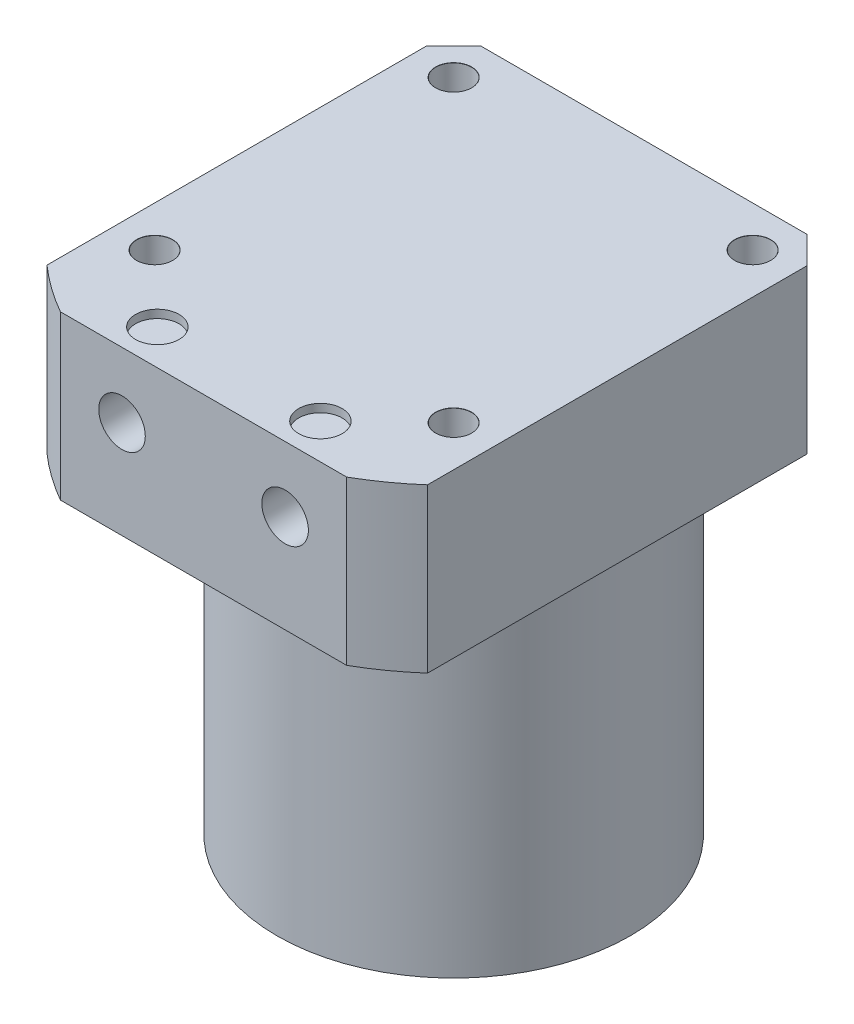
ISO-10303-21;
HEADER;
FILE_DESCRIPTION(('STEP AP214'),'2;1');
FILE_NAME('part.step','',(''),(''),'','','');
FILE_SCHEMA(('AUTOMOTIVE_DESIGN { 1 0 10303 214 1 1 1 1 }'));
ENDSEC;
DATA;
#1=APPLICATION_CONTEXT('core data for automotive mechanical design processes');
#2=APPLICATION_PROTOCOL_DEFINITION('international standard','automotive_design',2000,#1);
#3=PRODUCT_CONTEXT('',#1,'mechanical');
#4=PRODUCT('Part','Part','',(#3));
#5=PRODUCT_RELATED_PRODUCT_CATEGORY('part','',(#4));
#6=PRODUCT_DEFINITION_FORMATION('','',#4);
#7=PRODUCT_DEFINITION_CONTEXT('part definition',#1,'design');
#8=PRODUCT_DEFINITION('design','',#6,#7);
#9=PRODUCT_DEFINITION_SHAPE('','',#8);
#10=(LENGTH_UNIT() NAMED_UNIT(*) SI_UNIT(.MILLI.,.METRE.));
#11=(NAMED_UNIT(*) PLANE_ANGLE_UNIT() SI_UNIT($,.RADIAN.));
#12=(NAMED_UNIT(*) SI_UNIT($,.STERADIAN.) SOLID_ANGLE_UNIT());
#13=UNCERTAINTY_MEASURE_WITH_UNIT(LENGTH_MEASURE(1.E-05),#10,'distance_accuracy_value','');
#14=(GEOMETRIC_REPRESENTATION_CONTEXT(3) GLOBAL_UNCERTAINTY_ASSIGNED_CONTEXT((#13)) GLOBAL_UNIT_ASSIGNED_CONTEXT((#10,
#11,#12)) REPRESENTATION_CONTEXT('',''));
#15=CARTESIAN_POINT('',(0.,0.,0.));
#16=DIRECTION('',(0.,0.,1.));
#17=DIRECTION('',(1.,0.,0.));
#18=AXIS2_PLACEMENT_3D('',#15,#16,#17);
#19=CARTESIAN_POINT('',(-32.5,63.,0.));
#20=DIRECTION('',(0.,-1.,0.));
#21=DIRECTION('',(0.,0.,-1.));
#22=AXIS2_PLACEMENT_3D('',#19,#20,#21);
#23=PLANE('',#22);
#24=CARTESIAN_POINT('',(-27.5,63.,-27.5));
#25=DIRECTION('',(0.,-1.,0.));
#26=DIRECTION('',(0.,0.,-1.));
#27=AXIS2_PLACEMENT_3D('',#24,#25,#26);
#28=CIRCLE('',#27,5.5);
#29=CARTESIAN_POINT('',(-27.5,63.,-33.));
#30=VERTEX_POINT('',#29);
#31=EDGE_CURVE('E337',#30,#30,#28,.T.);
#32=ORIENTED_EDGE('',*,*,#31,.F.);
#33=EDGE_LOOP('',(#32));
#34=FACE_BOUND('',#33,.T.);
#35=CARTESIAN_POINT('',(27.5,63.,-27.5));
#36=DIRECTION('',(0.,-1.,0.));
#37=DIRECTION('',(0.,0.,-1.));
#38=AXIS2_PLACEMENT_3D('',#35,#36,#37);
#39=CIRCLE('',#38,5.5);
#40=CARTESIAN_POINT('',(27.5,63.,-33.));
#41=VERTEX_POINT('',#40);
#42=EDGE_CURVE('E352',#41,#41,#39,.T.);
#43=ORIENTED_EDGE('',*,*,#42,.F.);
#44=EDGE_LOOP('',(#43));
#45=FACE_BOUND('',#44,.T.);
#46=CARTESIAN_POINT('',(27.5,63.,27.5));
#47=DIRECTION('',(0.,-1.,0.));
#48=DIRECTION('',(0.,0.,-1.));
#49=AXIS2_PLACEMENT_3D('',#46,#47,#48);
#50=CIRCLE('',#49,5.5);
#51=CARTESIAN_POINT('',(27.5,63.,22.));
#52=VERTEX_POINT('',#51);
#53=EDGE_CURVE('E367',#52,#52,#50,.T.);
#54=ORIENTED_EDGE('',*,*,#53,.F.);
#55=EDGE_LOOP('',(#54));
#56=FACE_BOUND('',#55,.T.);
#57=CARTESIAN_POINT('',(-27.5,63.,27.5));
#58=DIRECTION('',(0.,-1.,0.));
#59=DIRECTION('',(0.,0.,-1.));
#60=AXIS2_PLACEMENT_3D('',#57,#58,#59);
#61=CIRCLE('',#60,5.5);
#62=CARTESIAN_POINT('',(-27.5,63.,22.));
#63=VERTEX_POINT('',#62);
#64=EDGE_CURVE('E382',#63,#63,#61,.T.);
#65=ORIENTED_EDGE('',*,*,#64,.F.);
#66=EDGE_LOOP('',(#65));
#67=FACE_BOUND('',#66,.T.);
#68=CARTESIAN_POINT('',(0.,63.,0.));
#69=DIRECTION('',(0.,1.,0.));
#70=DIRECTION('',(0.,0.,1.));
#71=AXIS2_PLACEMENT_3D('',#68,#69,#70);
#72=CIRCLE('',#71,32.5);
#73=CARTESIAN_POINT('',(0.,63.,32.5));
#74=VERTEX_POINT('',#73);
#75=EDGE_CURVE('E134',#74,#74,#72,.T.);
#76=ORIENTED_EDGE('',*,*,#75,.T.);
#77=EDGE_LOOP('',(#76));
#78=FACE_BOUND('',#77,.T.);
#79=DIRECTION('',(1.,0.,0.));
#80=VECTOR('',#79,1.);
#81=CARTESIAN_POINT('',(-32.5,63.,-35.));
#82=LINE('',#81,#80);
#83=CARTESIAN_POINT('',(-30.,63.,-35.));
#84=VERTEX_POINT('',#83);
#85=CARTESIAN_POINT('',(30.,63.,-35.));
#86=VERTEX_POINT('',#85);
#87=EDGE_CURVE('E108',#84,#86,#82,.T.);
#88=ORIENTED_EDGE('',*,*,#87,.T.);
#89=DIRECTION('',(-0.707106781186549,0.,-0.707106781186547));
#90=VECTOR('',#89,1.);
#91=CARTESIAN_POINT('',(16.2499999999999,63.,-48.75));
#92=LINE('',#91,#90);
#93=CARTESIAN_POINT('',(35.,63.,-30.));
#94=VERTEX_POINT('',#93);
#95=EDGE_CURVE('E42',#86,#94,#92,.F.);
#96=ORIENTED_EDGE('',*,*,#95,.T.);
#97=DIRECTION('',(0.,0.,1.));
#98=VECTOR('',#97,1.);
#99=CARTESIAN_POINT('',(35.,63.,0.));
#100=LINE('',#99,#98);
#101=CARTESIAN_POINT('',(35.,63.,39.7994974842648));
#102=VERTEX_POINT('',#101);
#103=EDGE_CURVE('E123',#94,#102,#100,.T.);
#104=ORIENTED_EDGE('',*,*,#103,.T.);
#105=CARTESIAN_POINT('',(0.,63.,0.));
#106=DIRECTION('',(0.,1.,0.));
#107=DIRECTION('',(0.,0.,1.));
#108=AXIS2_PLACEMENT_3D('',#105,#106,#107);
#109=CIRCLE('',#108,53.);
#110=CARTESIAN_POINT('',(26.3248931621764,63.,46.));
#111=VERTEX_POINT('',#110);
#112=EDGE_CURVE('E131',#111,#102,#109,.T.);
#113=ORIENTED_EDGE('',*,*,#112,.F.);
#114=DIRECTION('',(-1.,0.,0.));
#115=VECTOR('',#114,1.);
#116=CARTESIAN_POINT('',(-32.5,63.,46.));
#117=LINE('',#116,#115);
#118=CARTESIAN_POINT('',(-26.3248931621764,63.,46.));
#119=VERTEX_POINT('',#118);
#120=EDGE_CURVE('E178',#111,#119,#117,.T.);
#121=ORIENTED_EDGE('',*,*,#120,.T.);
#122=CARTESIAN_POINT('',(-35.,63.,39.7994974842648));
#123=VERTEX_POINT('',#122);
#124=EDGE_CURVE('E126',#123,#119,#109,.T.);
#125=ORIENTED_EDGE('',*,*,#124,.F.);
#126=DIRECTION('',(0.,0.,-1.));
#127=VECTOR('',#126,1.);
#128=CARTESIAN_POINT('',(-35.,63.,0.));
#129=LINE('',#128,#127);
#130=CARTESIAN_POINT('',(-35.,63.,-30.));
#131=VERTEX_POINT('',#130);
#132=EDGE_CURVE('E114',#123,#131,#129,.T.);
#133=ORIENTED_EDGE('',*,*,#132,.T.);
#134=DIRECTION('',(-0.707106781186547,0.,0.707106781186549));
#135=VECTOR('',#134,1.);
#136=CARTESIAN_POINT('',(-48.75,63.,-16.25));
#137=LINE('',#136,#135);
#138=EDGE_CURVE('E154',#131,#84,#137,.F.);
#139=ORIENTED_EDGE('',*,*,#138,.T.);
#140=EDGE_LOOP('',(#88,#96,#104,#113,#121,#125,#133,#139));
#141=FACE_BOUND('',#140,.T.);
#142=ADVANCED_FACE('F34',(#34,#45,#56,#67,#78,#141),#23,.T.);
#143=CARTESIAN_POINT('',(0.,87.0508296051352,0.));
#144=DIRECTION('',(0.,1.,0.));
#145=DIRECTION('',(0.,0.,1.));
#146=AXIS2_PLACEMENT_3D('',#143,#144,#145);
#147=CYLINDRICAL_SURFACE('',#146,53.);
#148=ORIENTED_EDGE('',*,*,#112,.T.);
#149=DIRECTION('',(0.,1.,0.));
#150=VECTOR('',#149,1.);
#151=CARTESIAN_POINT('',(35.,87.0508296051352,39.7994974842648));
#152=LINE('',#151,#150);
#153=CARTESIAN_POINT('',(35.,93.,39.7994974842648));
#154=VERTEX_POINT('',#153);
#155=EDGE_CURVE('E127',#102,#154,#152,.T.);
#156=ORIENTED_EDGE('',*,*,#155,.T.);
#157=CARTESIAN_POINT('',(0.,93.,0.));
#158=DIRECTION('',(0.,1.,0.));
#159=DIRECTION('',(0.,0.,1.));
#160=AXIS2_PLACEMENT_3D('',#157,#158,#159);
#161=CIRCLE('',#160,53.);
#162=CARTESIAN_POINT('',(26.3248931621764,93.,46.));
#163=VERTEX_POINT('',#162);
#164=EDGE_CURVE('E122',#163,#154,#161,.T.);
#165=ORIENTED_EDGE('',*,*,#164,.F.);
#166=DIRECTION('',(0.,1.,0.));
#167=VECTOR('',#166,1.);
#168=CARTESIAN_POINT('',(26.3248931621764,87.0508296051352,46.));
#169=LINE('',#168,#167);
#170=EDGE_CURVE('E181',#163,#111,#169,.F.);
#171=ORIENTED_EDGE('',*,*,#170,.T.);
#172=EDGE_LOOP('',(#148,#156,#165,#171));
#173=FACE_BOUND('',#172,.T.);
#174=ADVANCED_FACE('F185',(#173),#147,.T.);
#175=ORIENTED_EDGE('',*,*,#124,.T.);
#176=DIRECTION('',(0.,1.,0.));
#177=VECTOR('',#176,1.);
#178=CARTESIAN_POINT('',(-26.3248931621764,87.0508296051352,46.));
#179=LINE('',#178,#177);
#180=CARTESIAN_POINT('',(-26.3248931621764,93.,46.));
#181=VERTEX_POINT('',#180);
#182=EDGE_CURVE('E121',#119,#181,#179,.T.);
#183=ORIENTED_EDGE('',*,*,#182,.T.);
#184=CARTESIAN_POINT('',(-35.,93.,39.7994974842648));
#185=VERTEX_POINT('',#184);
#186=EDGE_CURVE('E105',#185,#181,#161,.T.);
#187=ORIENTED_EDGE('',*,*,#186,.F.);
#188=DIRECTION('',(0.,1.,0.));
#189=VECTOR('',#188,1.);
#190=CARTESIAN_POINT('',(-35.,87.0508296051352,39.7994974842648));
#191=LINE('',#190,#189);
#192=EDGE_CURVE('E112',#185,#123,#191,.F.);
#193=ORIENTED_EDGE('',*,*,#192,.T.);
#194=EDGE_LOOP('',(#175,#183,#187,#193));
#195=FACE_BOUND('',#194,.T.);
#196=ADVANCED_FACE('F120',(#195),#147,.T.);
#197=CARTESIAN_POINT('',(-53.,93.,0.));
#198=DIRECTION('',(0.,1.,0.));
#199=DIRECTION('',(0.,0.,1.));
#200=AXIS2_PLACEMENT_3D('',#197,#198,#199);
#201=PLANE('',#200);
#202=CARTESIAN_POINT('',(-27.5,93.,-27.5));
#203=DIRECTION('',(0.,-1.,0.));
#204=DIRECTION('',(0.,0.,-1.));
#205=AXIS2_PLACEMENT_3D('',#202,#203,#204);
#206=CIRCLE('',#205,3.32499999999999);
#207=CARTESIAN_POINT('',(-27.5,93.,-30.825));
#208=VERTEX_POINT('',#207);
#209=EDGE_CURVE('E338',#208,#208,#206,.T.);
#210=ORIENTED_EDGE('',*,*,#209,.T.);
#211=EDGE_LOOP('',(#210));
#212=FACE_BOUND('',#211,.T.);
#213=CARTESIAN_POINT('',(27.5,93.,-27.5));
#214=DIRECTION('',(0.,-1.,0.));
#215=DIRECTION('',(0.,0.,-1.));
#216=AXIS2_PLACEMENT_3D('',#213,#214,#215);
#217=CIRCLE('',#216,3.32499999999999);
#218=CARTESIAN_POINT('',(27.5,93.,-30.825));
#219=VERTEX_POINT('',#218);
#220=EDGE_CURVE('E349',#219,#219,#217,.T.);
#221=ORIENTED_EDGE('',*,*,#220,.T.);
#222=EDGE_LOOP('',(#221));
#223=FACE_BOUND('',#222,.T.);
#224=CARTESIAN_POINT('',(27.5,93.,27.5));
#225=DIRECTION('',(0.,-1.,0.));
#226=DIRECTION('',(0.,0.,-1.));
#227=AXIS2_PLACEMENT_3D('',#224,#225,#226);
#228=CIRCLE('',#227,3.32499999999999);
#229=CARTESIAN_POINT('',(27.5,93.,24.175));
#230=VERTEX_POINT('',#229);
#231=EDGE_CURVE('E364',#230,#230,#228,.T.);
#232=ORIENTED_EDGE('',*,*,#231,.T.);
#233=EDGE_LOOP('',(#232));
#234=FACE_BOUND('',#233,.T.);
#235=CARTESIAN_POINT('',(-27.5,93.,27.5));
#236=DIRECTION('',(0.,-1.,0.));
#237=DIRECTION('',(0.,0.,-1.));
#238=AXIS2_PLACEMENT_3D('',#235,#236,#237);
#239=CIRCLE('',#238,3.32499999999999);
#240=CARTESIAN_POINT('',(-27.5,93.,24.175));
#241=VERTEX_POINT('',#240);
#242=EDGE_CURVE('E379',#241,#241,#239,.T.);
#243=ORIENTED_EDGE('',*,*,#242,.T.);
#244=EDGE_LOOP('',(#243));
#245=FACE_BOUND('',#244,.T.);
#246=CARTESIAN_POINT('',(-15.,93.,39.5));
#247=DIRECTION('',(0.,1.,0.));
#248=DIRECTION('',(0.,0.,1.));
#249=AXIS2_PLACEMENT_3D('',#246,#247,#248);
#250=CIRCLE('',#249,4.);
#251=CARTESIAN_POINT('',(-15.,93.,43.5));
#252=VERTEX_POINT('',#251);
#253=EDGE_CURVE('E406',#252,#252,#250,.T.);
#254=ORIENTED_EDGE('',*,*,#253,.F.);
#255=EDGE_LOOP('',(#254));
#256=FACE_BOUND('',#255,.T.);
#257=CARTESIAN_POINT('',(15.,93.,39.5));
#258=DIRECTION('',(0.,1.,0.));
#259=DIRECTION('',(0.,0.,1.));
#260=AXIS2_PLACEMENT_3D('',#257,#258,#259);
#261=CIRCLE('',#260,4.);
#262=CARTESIAN_POINT('',(15.,93.,43.5));
#263=VERTEX_POINT('',#262);
#264=EDGE_CURVE('E171',#263,#263,#261,.T.);
#265=ORIENTED_EDGE('',*,*,#264,.F.);
#266=EDGE_LOOP('',(#265));
#267=FACE_BOUND('',#266,.T.);
#268=DIRECTION('',(0.,0.,-1.));
#269=VECTOR('',#268,1.);
#270=CARTESIAN_POINT('',(35.,93.,0.));
#271=LINE('',#270,#269);
#272=CARTESIAN_POINT('',(35.,93.,-30.));
#273=VERTEX_POINT('',#272);
#274=EDGE_CURVE('E140',#154,#273,#271,.T.);
#275=ORIENTED_EDGE('',*,*,#274,.T.);
#276=DIRECTION('',(0.707106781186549,0.,0.707106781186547));
#277=VECTOR('',#276,1.);
#278=CARTESIAN_POINT('',(5.99999999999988,93.,-59.));
#279=LINE('',#278,#277);
#280=CARTESIAN_POINT('',(30.,93.,-35.));
#281=VERTEX_POINT('',#280);
#282=EDGE_CURVE('E148',#273,#281,#279,.F.);
#283=ORIENTED_EDGE('',*,*,#282,.T.);
#284=DIRECTION('',(-1.,0.,0.));
#285=VECTOR('',#284,1.);
#286=CARTESIAN_POINT('',(-35.,93.,-35.));
#287=LINE('',#286,#285);
#288=CARTESIAN_POINT('',(-30.,93.,-35.));
#289=VERTEX_POINT('',#288);
#290=EDGE_CURVE('E109',#281,#289,#287,.T.);
#291=ORIENTED_EDGE('',*,*,#290,.T.);
#292=DIRECTION('',(0.707106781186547,0.,-0.707106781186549));
#293=VECTOR('',#292,1.);
#294=CARTESIAN_POINT('',(-59.,93.,-5.99999999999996));
#295=LINE('',#294,#293);
#296=CARTESIAN_POINT('',(-35.,93.,-30.));
#297=VERTEX_POINT('',#296);
#298=EDGE_CURVE('E107',#289,#297,#295,.F.);
#299=ORIENTED_EDGE('',*,*,#298,.T.);
#300=DIRECTION('',(0.,0.,1.));
#301=VECTOR('',#300,1.);
#302=CARTESIAN_POINT('',(-35.,93.,-35.));
#303=LINE('',#302,#301);
#304=EDGE_CURVE('E99',#297,#185,#303,.T.);
#305=ORIENTED_EDGE('',*,*,#304,.T.);
#306=ORIENTED_EDGE('',*,*,#186,.T.);
#307=DIRECTION('',(1.,0.,0.));
#308=VECTOR('',#307,1.);
#309=CARTESIAN_POINT('',(-53.,93.,46.));
#310=LINE('',#309,#308);
#311=EDGE_CURVE('E142',#181,#163,#310,.T.);
#312=ORIENTED_EDGE('',*,*,#311,.T.);
#313=ORIENTED_EDGE('',*,*,#164,.T.);
#314=EDGE_LOOP('',(#275,#283,#291,#299,#305,#306,#312,#313));
#315=FACE_BOUND('',#314,.T.);
#316=ADVANCED_FACE('F102',(#212,#223,#234,#245,#256,#267,#315),#201,.T.);
#317=CARTESIAN_POINT('',(0.,0.,0.));
#318=DIRECTION('',(0.,-1.,0.));
#319=DIRECTION('',(0.,0.,-1.));
#320=AXIS2_PLACEMENT_3D('',#317,#318,#319);
#321=PLANE('',#320);
#322=CARTESIAN_POINT('',(0.,0.,0.));
#323=DIRECTION('',(0.,1.,0.));
#324=DIRECTION('',(0.,0.,1.));
#325=AXIS2_PLACEMENT_3D('',#322,#323,#324);
#326=CIRCLE('',#325,32.5);
#327=CARTESIAN_POINT('',(0.,0.,32.5));
#328=VERTEX_POINT('',#327);
#329=EDGE_CURVE('E137',#328,#328,#326,.T.);
#330=ORIENTED_EDGE('',*,*,#329,.F.);
#331=EDGE_LOOP('',(#330));
#332=FACE_BOUND('',#331,.T.);
#333=ADVANCED_FACE('F213',(#332),#321,.T.);
#334=CARTESIAN_POINT('',(0.,87.0508296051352,0.));
#335=DIRECTION('',(0.,1.,0.));
#336=DIRECTION('',(0.,0.,1.));
#337=AXIS2_PLACEMENT_3D('',#334,#335,#336);
#338=CYLINDRICAL_SURFACE('',#337,32.5);
#339=ORIENTED_EDGE('',*,*,#329,.T.);
#340=EDGE_LOOP('',(#339));
#341=FACE_BOUND('',#340,.T.);
#342=ORIENTED_EDGE('',*,*,#75,.F.);
#343=EDGE_LOOP('',(#342));
#344=FACE_BOUND('',#343,.T.);
#345=ADVANCED_FACE('F210',(#341,#344),#338,.T.);
#346=CARTESIAN_POINT('',(-35.,0.,-35.));
#347=DIRECTION('',(0.,0.,-1.));
#348=DIRECTION('',(-1.,0.,0.));
#349=AXIS2_PLACEMENT_3D('',#346,#347,#348);
#350=PLANE('',#349);
#351=ORIENTED_EDGE('',*,*,#290,.F.);
#352=DIRECTION('',(0.,-1.,0.));
#353=VECTOR('',#352,1.);
#354=CARTESIAN_POINT('',(30.,0.,-35.));
#355=LINE('',#354,#353);
#356=EDGE_CURVE('E55',#281,#86,#355,.T.);
#357=ORIENTED_EDGE('',*,*,#356,.T.);
#358=ORIENTED_EDGE('',*,*,#87,.F.);
#359=DIRECTION('',(0.,1.,0.));
#360=VECTOR('',#359,1.);
#361=CARTESIAN_POINT('',(-30.,0.,-35.));
#362=LINE('',#361,#360);
#363=EDGE_CURVE('E150',#84,#289,#362,.T.);
#364=ORIENTED_EDGE('',*,*,#363,.T.);
#365=EDGE_LOOP('',(#351,#357,#358,#364));
#366=FACE_BOUND('',#365,.T.);
#367=ADVANCED_FACE('F166',(#366),#350,.T.);
#368=CARTESIAN_POINT('',(-35.,0.,-35.));
#369=DIRECTION('',(-1.,0.,0.));
#370=DIRECTION('',(0.,0.,1.));
#371=AXIS2_PLACEMENT_3D('',#368,#369,#370);
#372=PLANE('',#371);
#373=ORIENTED_EDGE('',*,*,#304,.F.);
#374=DIRECTION('',(0.,-1.,0.));
#375=VECTOR('',#374,1.);
#376=CARTESIAN_POINT('',(-35.,0.,-30.));
#377=LINE('',#376,#375);
#378=EDGE_CURVE('E12',#297,#131,#377,.T.);
#379=ORIENTED_EDGE('',*,*,#378,.T.);
#380=ORIENTED_EDGE('',*,*,#132,.F.);
#381=ORIENTED_EDGE('',*,*,#192,.F.);
#382=EDGE_LOOP('',(#373,#379,#380,#381));
#383=FACE_BOUND('',#382,.T.);
#384=ADVANCED_FACE('F113',(#383),#372,.T.);
#385=CARTESIAN_POINT('',(35.,0.,-35.));
#386=DIRECTION('',(1.,0.,0.));
#387=DIRECTION('',(0.,0.,-1.));
#388=AXIS2_PLACEMENT_3D('',#385,#386,#387);
#389=PLANE('',#388);
#390=ORIENTED_EDGE('',*,*,#103,.F.);
#391=DIRECTION('',(0.,1.,0.));
#392=VECTOR('',#391,1.);
#393=CARTESIAN_POINT('',(35.,0.,-30.));
#394=LINE('',#393,#392);
#395=EDGE_CURVE('E144',#94,#273,#394,.T.);
#396=ORIENTED_EDGE('',*,*,#395,.T.);
#397=ORIENTED_EDGE('',*,*,#274,.F.);
#398=ORIENTED_EDGE('',*,*,#155,.F.);
#399=EDGE_LOOP('',(#390,#396,#397,#398));
#400=FACE_BOUND('',#399,.T.);
#401=ADVANCED_FACE('F163',(#400),#389,.T.);
#402=CARTESIAN_POINT('',(-35.,0.,46.));
#403=DIRECTION('',(0.,0.,1.));
#404=DIRECTION('',(1.,0.,0.));
#405=AXIS2_PLACEMENT_3D('',#402,#403,#404);
#406=PLANE('',#405);
#407=CARTESIAN_POINT('',(-15.,81.,46.));
#408=DIRECTION('',(0.,0.,1.));
#409=DIRECTION('',(1.,0.,0.));
#410=AXIS2_PLACEMENT_3D('',#407,#408,#409);
#411=CIRCLE('',#410,4.283);
#412=CARTESIAN_POINT('',(-10.717,81.,46.));
#413=VERTEX_POINT('',#412);
#414=EDGE_CURVE('E394',#413,#413,#411,.T.);
#415=ORIENTED_EDGE('',*,*,#414,.F.);
#416=EDGE_LOOP('',(#415));
#417=FACE_BOUND('',#416,.T.);
#418=CARTESIAN_POINT('',(15.,81.,46.));
#419=DIRECTION('',(0.,0.,1.));
#420=DIRECTION('',(1.,0.,0.));
#421=AXIS2_PLACEMENT_3D('',#418,#419,#420);
#422=CIRCLE('',#421,4.283);
#423=CARTESIAN_POINT('',(19.283,81.,46.));
#424=VERTEX_POINT('',#423);
#425=EDGE_CURVE('E400',#424,#424,#422,.T.);
#426=ORIENTED_EDGE('',*,*,#425,.F.);
#427=EDGE_LOOP('',(#426));
#428=FACE_BOUND('',#427,.T.);
#429=ORIENTED_EDGE('',*,*,#311,.F.);
#430=ORIENTED_EDGE('',*,*,#182,.F.);
#431=ORIENTED_EDGE('',*,*,#120,.F.);
#432=ORIENTED_EDGE('',*,*,#170,.F.);
#433=EDGE_LOOP('',(#429,#430,#431,#432));
#434=FACE_BOUND('',#433,.T.);
#435=ADVANCED_FACE('F187',(#417,#428,#434),#406,.T.);
#436=CARTESIAN_POINT('',(35.,0.,-30.));
#437=DIRECTION('',(-0.707106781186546,0.,0.707106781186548));
#438=DIRECTION('',(0.707106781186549,0.,0.707106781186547));
#439=AXIS2_PLACEMENT_3D('',#436,#437,#438);
#440=PLANE('',#439);
#441=ORIENTED_EDGE('',*,*,#95,.F.);
#442=ORIENTED_EDGE('',*,*,#356,.F.);
#443=ORIENTED_EDGE('',*,*,#282,.F.);
#444=ORIENTED_EDGE('',*,*,#395,.F.);
#445=EDGE_LOOP('',(#441,#442,#443,#444));
#446=FACE_BOUND('',#445,.T.);
#447=ADVANCED_FACE('F165',(#446),#440,.F.);
#448=CARTESIAN_POINT('',(-30.,0.,-35.));
#449=DIRECTION('',(0.707106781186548,0.,0.707106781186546));
#450=DIRECTION('',(0.707106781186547,0.,-0.707106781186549));
#451=AXIS2_PLACEMENT_3D('',#448,#449,#450);
#452=PLANE('',#451);
#453=ORIENTED_EDGE('',*,*,#138,.F.);
#454=ORIENTED_EDGE('',*,*,#378,.F.);
#455=ORIENTED_EDGE('',*,*,#298,.F.);
#456=ORIENTED_EDGE('',*,*,#363,.F.);
#457=EDGE_LOOP('',(#453,#454,#455,#456));
#458=FACE_BOUND('',#457,.T.);
#459=ADVANCED_FACE('F36',(#458),#452,.F.);
#460=CARTESIAN_POINT('',(15.,91.5,39.5));
#461=DIRECTION('',(0.,-1.,0.));
#462=DIRECTION('',(0.,0.,-1.));
#463=AXIS2_PLACEMENT_3D('',#460,#461,#462);
#464=PLANE('',#463);
#465=CARTESIAN_POINT('',(15.,91.5,39.5));
#466=DIRECTION('',(0.,1.,0.));
#467=DIRECTION('',(0.,0.,1.));
#468=AXIS2_PLACEMENT_3D('',#465,#466,#467);
#469=CIRCLE('',#468,4.);
#470=CARTESIAN_POINT('',(15.,91.5,43.5));
#471=VERTEX_POINT('',#470);
#472=EDGE_CURVE('E168',#471,#471,#469,.T.);
#473=ORIENTED_EDGE('',*,*,#472,.T.);
#474=EDGE_LOOP('',(#473));
#475=FACE_BOUND('',#474,.T.);
#476=ADVANCED_FACE('F191',(#475),#464,.F.);
#477=CARTESIAN_POINT('',(15.,93.,39.5));
#478=DIRECTION('',(0.,1.,0.));
#479=DIRECTION('',(0.,0.,1.));
#480=AXIS2_PLACEMENT_3D('',#477,#478,#479);
#481=CYLINDRICAL_SURFACE('',#480,4.);
#482=ORIENTED_EDGE('',*,*,#472,.F.);
#483=EDGE_LOOP('',(#482));
#484=FACE_BOUND('',#483,.T.);
#485=ORIENTED_EDGE('',*,*,#264,.T.);
#486=EDGE_LOOP('',(#485));
#487=FACE_BOUND('',#486,.T.);
#488=ADVANCED_FACE('F196',(#484,#487),#481,.F.);
#489=CARTESIAN_POINT('',(-15.,91.5,39.5));
#490=DIRECTION('',(0.,-1.,0.));
#491=DIRECTION('',(0.,0.,-1.));
#492=AXIS2_PLACEMENT_3D('',#489,#490,#491);
#493=PLANE('',#492);
#494=CARTESIAN_POINT('',(-15.,91.5,39.5));
#495=DIRECTION('',(0.,1.,0.));
#496=DIRECTION('',(0.,0.,1.));
#497=AXIS2_PLACEMENT_3D('',#494,#495,#496);
#498=CIRCLE('',#497,4.);
#499=CARTESIAN_POINT('',(-15.,91.5,43.5));
#500=VERTEX_POINT('',#499);
#501=EDGE_CURVE('E409',#500,#500,#498,.T.);
#502=ORIENTED_EDGE('',*,*,#501,.T.);
#503=EDGE_LOOP('',(#502));
#504=FACE_BOUND('',#503,.T.);
#505=ADVANCED_FACE('F242',(#504),#493,.F.);
#506=CARTESIAN_POINT('',(-15.,93.,39.5));
#507=DIRECTION('',(0.,1.,0.));
#508=DIRECTION('',(0.,0.,1.));
#509=AXIS2_PLACEMENT_3D('',#506,#507,#508);
#510=CYLINDRICAL_SURFACE('',#509,4.);
#511=ORIENTED_EDGE('',*,*,#501,.F.);
#512=EDGE_LOOP('',(#511));
#513=FACE_BOUND('',#512,.T.);
#514=ORIENTED_EDGE('',*,*,#253,.T.);
#515=EDGE_LOOP('',(#514));
#516=FACE_BOUND('',#515,.T.);
#517=ADVANCED_FACE('F246',(#513,#516),#510,.F.);
#518=CARTESIAN_POINT('',(15.,81.,23.82));
#519=DIRECTION('',(0.,0.,-1.));
#520=DIRECTION('',(-1.,0.,0.));
#521=AXIS2_PLACEMENT_3D('',#518,#519,#520);
#522=PLANE('',#521);
#523=CARTESIAN_POINT('',(15.,81.,23.82));
#524=DIRECTION('',(0.,0.,1.));
#525=DIRECTION('',(1.,0.,0.));
#526=AXIS2_PLACEMENT_3D('',#523,#524,#525);
#527=CIRCLE('',#526,4.283);
#528=CARTESIAN_POINT('',(19.283,81.,23.82));
#529=VERTEX_POINT('',#528);
#530=EDGE_CURVE('E403',#529,#529,#527,.T.);
#531=ORIENTED_EDGE('',*,*,#530,.T.);
#532=EDGE_LOOP('',(#531));
#533=FACE_BOUND('',#532,.T.);
#534=ADVANCED_FACE('F250',(#533),#522,.F.);
#535=CARTESIAN_POINT('',(15.,81.,46.));
#536=DIRECTION('',(0.,0.,1.));
#537=DIRECTION('',(1.,0.,0.));
#538=AXIS2_PLACEMENT_3D('',#535,#536,#537);
#539=CYLINDRICAL_SURFACE('',#538,4.283);
#540=ORIENTED_EDGE('',*,*,#530,.F.);
#541=EDGE_LOOP('',(#540));
#542=FACE_BOUND('',#541,.T.);
#543=ORIENTED_EDGE('',*,*,#425,.T.);
#544=EDGE_LOOP('',(#543));
#545=FACE_BOUND('',#544,.T.);
#546=ADVANCED_FACE('F254',(#542,#545),#539,.F.);
#547=CARTESIAN_POINT('',(-15.,81.,23.82));
#548=DIRECTION('',(0.,0.,-1.));
#549=DIRECTION('',(-1.,0.,0.));
#550=AXIS2_PLACEMENT_3D('',#547,#548,#549);
#551=PLANE('',#550);
#552=CARTESIAN_POINT('',(-15.,81.,23.82));
#553=DIRECTION('',(0.,0.,1.));
#554=DIRECTION('',(1.,0.,0.));
#555=AXIS2_PLACEMENT_3D('',#552,#553,#554);
#556=CIRCLE('',#555,4.283);
#557=CARTESIAN_POINT('',(-10.717,81.,23.82));
#558=VERTEX_POINT('',#557);
#559=EDGE_CURVE('E397',#558,#558,#556,.T.);
#560=ORIENTED_EDGE('',*,*,#559,.T.);
#561=EDGE_LOOP('',(#560));
#562=FACE_BOUND('',#561,.T.);
#563=ADVANCED_FACE('F258',(#562),#551,.F.);
#564=CARTESIAN_POINT('',(-15.,81.,46.));
#565=DIRECTION('',(0.,0.,1.));
#566=DIRECTION('',(1.,0.,0.));
#567=AXIS2_PLACEMENT_3D('',#564,#565,#566);
#568=CYLINDRICAL_SURFACE('',#567,4.283);
#569=ORIENTED_EDGE('',*,*,#559,.F.);
#570=EDGE_LOOP('',(#569));
#571=FACE_BOUND('',#570,.T.);
#572=ORIENTED_EDGE('',*,*,#414,.T.);
#573=EDGE_LOOP('',(#572));
#574=FACE_BOUND('',#573,.T.);
#575=ADVANCED_FACE('F262',(#571,#574),#568,.F.);
#576=CARTESIAN_POINT('',(-27.5,92.975,27.5));
#577=DIRECTION('',(0.,1.,0.));
#578=DIRECTION('',(0.,0.,1.));
#579=AXIS2_PLACEMENT_3D('',#576,#577,#578);
#580=CONICAL_SURFACE('',#579,3.29999999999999,0.78539816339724);
#581=ORIENTED_EDGE('',*,*,#242,.F.);
#582=EDGE_LOOP('',(#581));
#583=FACE_BOUND('',#582,.T.);
#584=CARTESIAN_POINT('',(-27.5,92.975,27.5));
#585=DIRECTION('',(0.,-1.,0.));
#586=DIRECTION('',(0.,0.,-1.));
#587=AXIS2_PLACEMENT_3D('',#584,#585,#586);
#588=CIRCLE('',#587,3.29999999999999);
#589=CARTESIAN_POINT('',(-27.5,92.975,24.2));
#590=VERTEX_POINT('',#589);
#591=EDGE_CURVE('E391',#590,#590,#588,.T.);
#592=ORIENTED_EDGE('',*,*,#591,.T.);
#593=EDGE_LOOP('',(#592));
#594=FACE_BOUND('',#593,.T.);
#595=ADVANCED_FACE('F266',(#583,#594),#580,.F.);
#596=CARTESIAN_POINT('',(-27.5,63.,27.5));
#597=DIRECTION('',(0.,-1.,0.));
#598=DIRECTION('',(0.,0.,-1.));
#599=AXIS2_PLACEMENT_3D('',#596,#597,#598);
#600=CYLINDRICAL_SURFACE('',#599,3.3);
#601=ORIENTED_EDGE('',*,*,#591,.F.);
#602=EDGE_LOOP('',(#601));
#603=FACE_BOUND('',#602,.T.);
#604=CARTESIAN_POINT('',(-27.5,69.,27.5));
#605=DIRECTION('',(0.,-1.,0.));
#606=DIRECTION('',(0.,0.,-1.));
#607=AXIS2_PLACEMENT_3D('',#604,#605,#606);
#608=CIRCLE('',#607,3.3);
#609=CARTESIAN_POINT('',(-27.5,69.,24.2));
#610=VERTEX_POINT('',#609);
#611=EDGE_CURVE('E388',#610,#610,#608,.T.);
#612=ORIENTED_EDGE('',*,*,#611,.T.);
#613=EDGE_LOOP('',(#612));
#614=FACE_BOUND('',#613,.T.);
#615=ADVANCED_FACE('F270',(#603,#614),#600,.F.);
#616=CARTESIAN_POINT('',(-24.2,69.,27.5));
#617=DIRECTION('',(0.,1.,0.));
#618=DIRECTION('',(0.,0.,1.));
#619=AXIS2_PLACEMENT_3D('',#616,#617,#618);
#620=PLANE('',#619);
#621=ORIENTED_EDGE('',*,*,#611,.F.);
#622=EDGE_LOOP('',(#621));
#623=FACE_BOUND('',#622,.T.);
#624=CARTESIAN_POINT('',(-27.5,69.,27.5));
#625=DIRECTION('',(0.,-1.,0.));
#626=DIRECTION('',(0.,0.,-1.));
#627=AXIS2_PLACEMENT_3D('',#624,#625,#626);
#628=CIRCLE('',#627,5.5);
#629=CARTESIAN_POINT('',(-27.5,69.,22.));
#630=VERTEX_POINT('',#629);
#631=EDGE_CURVE('E385',#630,#630,#628,.T.);
#632=ORIENTED_EDGE('',*,*,#631,.T.);
#633=EDGE_LOOP('',(#632));
#634=FACE_BOUND('',#633,.T.);
#635=ADVANCED_FACE('F274',(#623,#634),#620,.F.);
#636=CARTESIAN_POINT('',(-27.5,63.,27.5));
#637=DIRECTION('',(0.,-1.,0.));
#638=DIRECTION('',(0.,0.,-1.));
#639=AXIS2_PLACEMENT_3D('',#636,#637,#638);
#640=CYLINDRICAL_SURFACE('',#639,5.5);
#641=ORIENTED_EDGE('',*,*,#631,.F.);
#642=EDGE_LOOP('',(#641));
#643=FACE_BOUND('',#642,.T.);
#644=ORIENTED_EDGE('',*,*,#64,.T.);
#645=EDGE_LOOP('',(#644));
#646=FACE_BOUND('',#645,.T.);
#647=ADVANCED_FACE('F278',(#643,#646),#640,.F.);
#648=CARTESIAN_POINT('',(27.5,92.975,27.5));
#649=DIRECTION('',(0.,1.,0.));
#650=DIRECTION('',(0.,0.,1.));
#651=AXIS2_PLACEMENT_3D('',#648,#649,#650);
#652=CONICAL_SURFACE('',#651,3.29999999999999,0.78539816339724);
#653=ORIENTED_EDGE('',*,*,#231,.F.);
#654=EDGE_LOOP('',(#653));
#655=FACE_BOUND('',#654,.T.);
#656=CARTESIAN_POINT('',(27.5,92.975,27.5));
#657=DIRECTION('',(0.,-1.,0.));
#658=DIRECTION('',(0.,0.,-1.));
#659=AXIS2_PLACEMENT_3D('',#656,#657,#658);
#660=CIRCLE('',#659,3.29999999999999);
#661=CARTESIAN_POINT('',(27.5,92.975,24.2));
#662=VERTEX_POINT('',#661);
#663=EDGE_CURVE('E376',#662,#662,#660,.T.);
#664=ORIENTED_EDGE('',*,*,#663,.T.);
#665=EDGE_LOOP('',(#664));
#666=FACE_BOUND('',#665,.T.);
#667=ADVANCED_FACE('F282',(#655,#666),#652,.F.);
#668=CARTESIAN_POINT('',(27.5,63.,27.5));
#669=DIRECTION('',(0.,-1.,0.));
#670=DIRECTION('',(0.,0.,-1.));
#671=AXIS2_PLACEMENT_3D('',#668,#669,#670);
#672=CYLINDRICAL_SURFACE('',#671,3.3);
#673=ORIENTED_EDGE('',*,*,#663,.F.);
#674=EDGE_LOOP('',(#673));
#675=FACE_BOUND('',#674,.T.);
#676=CARTESIAN_POINT('',(27.5,69.,27.5));
#677=DIRECTION('',(0.,-1.,0.));
#678=DIRECTION('',(0.,0.,-1.));
#679=AXIS2_PLACEMENT_3D('',#676,#677,#678);
#680=CIRCLE('',#679,3.3);
#681=CARTESIAN_POINT('',(27.5,69.,24.2));
#682=VERTEX_POINT('',#681);
#683=EDGE_CURVE('E373',#682,#682,#680,.T.);
#684=ORIENTED_EDGE('',*,*,#683,.T.);
#685=EDGE_LOOP('',(#684));
#686=FACE_BOUND('',#685,.T.);
#687=ADVANCED_FACE('F286',(#675,#686),#672,.F.);
#688=CARTESIAN_POINT('',(30.8,69.,27.5));
#689=DIRECTION('',(0.,1.,0.));
#690=DIRECTION('',(0.,0.,1.));
#691=AXIS2_PLACEMENT_3D('',#688,#689,#690);
#692=PLANE('',#691);
#693=ORIENTED_EDGE('',*,*,#683,.F.);
#694=EDGE_LOOP('',(#693));
#695=FACE_BOUND('',#694,.T.);
#696=CARTESIAN_POINT('',(27.5,69.,27.5));
#697=DIRECTION('',(0.,-1.,0.));
#698=DIRECTION('',(0.,0.,-1.));
#699=AXIS2_PLACEMENT_3D('',#696,#697,#698);
#700=CIRCLE('',#699,5.5);
#701=CARTESIAN_POINT('',(27.5,69.,22.));
#702=VERTEX_POINT('',#701);
#703=EDGE_CURVE('E370',#702,#702,#700,.T.);
#704=ORIENTED_EDGE('',*,*,#703,.T.);
#705=EDGE_LOOP('',(#704));
#706=FACE_BOUND('',#705,.T.);
#707=ADVANCED_FACE('F290',(#695,#706),#692,.F.);
#708=CARTESIAN_POINT('',(27.5,63.,27.5));
#709=DIRECTION('',(0.,-1.,0.));
#710=DIRECTION('',(0.,0.,-1.));
#711=AXIS2_PLACEMENT_3D('',#708,#709,#710);
#712=CYLINDRICAL_SURFACE('',#711,5.5);
#713=ORIENTED_EDGE('',*,*,#703,.F.);
#714=EDGE_LOOP('',(#713));
#715=FACE_BOUND('',#714,.T.);
#716=ORIENTED_EDGE('',*,*,#53,.T.);
#717=EDGE_LOOP('',(#716));
#718=FACE_BOUND('',#717,.T.);
#719=ADVANCED_FACE('F294',(#715,#718),#712,.F.);
#720=CARTESIAN_POINT('',(27.5,92.975,-27.5));
#721=DIRECTION('',(0.,1.,0.));
#722=DIRECTION('',(0.,0.,1.));
#723=AXIS2_PLACEMENT_3D('',#720,#721,#722);
#724=CONICAL_SURFACE('',#723,3.29999999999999,0.78539816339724);
#725=ORIENTED_EDGE('',*,*,#220,.F.);
#726=EDGE_LOOP('',(#725));
#727=FACE_BOUND('',#726,.T.);
#728=CARTESIAN_POINT('',(27.5,92.975,-27.5));
#729=DIRECTION('',(0.,-1.,0.));
#730=DIRECTION('',(0.,0.,-1.));
#731=AXIS2_PLACEMENT_3D('',#728,#729,#730);
#732=CIRCLE('',#731,3.29999999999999);
#733=CARTESIAN_POINT('',(27.5,92.975,-30.8));
#734=VERTEX_POINT('',#733);
#735=EDGE_CURVE('E361',#734,#734,#732,.T.);
#736=ORIENTED_EDGE('',*,*,#735,.T.);
#737=EDGE_LOOP('',(#736));
#738=FACE_BOUND('',#737,.T.);
#739=ADVANCED_FACE('F298',(#727,#738),#724,.F.);
#740=CARTESIAN_POINT('',(27.5,63.,-27.5));
#741=DIRECTION('',(0.,-1.,0.));
#742=DIRECTION('',(0.,0.,-1.));
#743=AXIS2_PLACEMENT_3D('',#740,#741,#742);
#744=CYLINDRICAL_SURFACE('',#743,3.3);
#745=ORIENTED_EDGE('',*,*,#735,.F.);
#746=EDGE_LOOP('',(#745));
#747=FACE_BOUND('',#746,.T.);
#748=CARTESIAN_POINT('',(27.5,69.,-27.5));
#749=DIRECTION('',(0.,-1.,0.));
#750=DIRECTION('',(0.,0.,-1.));
#751=AXIS2_PLACEMENT_3D('',#748,#749,#750);
#752=CIRCLE('',#751,3.3);
#753=CARTESIAN_POINT('',(27.5,69.,-30.8));
#754=VERTEX_POINT('',#753);
#755=EDGE_CURVE('E358',#754,#754,#752,.T.);
#756=ORIENTED_EDGE('',*,*,#755,.T.);
#757=EDGE_LOOP('',(#756));
#758=FACE_BOUND('',#757,.T.);
#759=ADVANCED_FACE('F302',(#747,#758),#744,.F.);
#760=CARTESIAN_POINT('',(30.8,69.,-27.5));
#761=DIRECTION('',(0.,1.,0.));
#762=DIRECTION('',(0.,0.,1.));
#763=AXIS2_PLACEMENT_3D('',#760,#761,#762);
#764=PLANE('',#763);
#765=ORIENTED_EDGE('',*,*,#755,.F.);
#766=EDGE_LOOP('',(#765));
#767=FACE_BOUND('',#766,.T.);
#768=CARTESIAN_POINT('',(27.5,69.,-27.5));
#769=DIRECTION('',(0.,-1.,0.));
#770=DIRECTION('',(0.,0.,-1.));
#771=AXIS2_PLACEMENT_3D('',#768,#769,#770);
#772=CIRCLE('',#771,5.5);
#773=CARTESIAN_POINT('',(27.5,69.,-33.));
#774=VERTEX_POINT('',#773);
#775=EDGE_CURVE('E355',#774,#774,#772,.T.);
#776=ORIENTED_EDGE('',*,*,#775,.T.);
#777=EDGE_LOOP('',(#776));
#778=FACE_BOUND('',#777,.T.);
#779=ADVANCED_FACE('F306',(#767,#778),#764,.F.);
#780=CARTESIAN_POINT('',(27.5,63.,-27.5));
#781=DIRECTION('',(0.,-1.,0.));
#782=DIRECTION('',(0.,0.,-1.));
#783=AXIS2_PLACEMENT_3D('',#780,#781,#782);
#784=CYLINDRICAL_SURFACE('',#783,5.5);
#785=ORIENTED_EDGE('',*,*,#775,.F.);
#786=EDGE_LOOP('',(#785));
#787=FACE_BOUND('',#786,.T.);
#788=ORIENTED_EDGE('',*,*,#42,.T.);
#789=EDGE_LOOP('',(#788));
#790=FACE_BOUND('',#789,.T.);
#791=ADVANCED_FACE('F310',(#787,#790),#784,.F.);
#792=CARTESIAN_POINT('',(-27.5,92.975,-27.5));
#793=DIRECTION('',(0.,1.,0.));
#794=DIRECTION('',(0.,0.,1.));
#795=AXIS2_PLACEMENT_3D('',#792,#793,#794);
#796=CONICAL_SURFACE('',#795,3.29999999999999,0.78539816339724);
#797=ORIENTED_EDGE('',*,*,#209,.F.);
#798=EDGE_LOOP('',(#797));
#799=FACE_BOUND('',#798,.T.);
#800=CARTESIAN_POINT('',(-27.5,92.975,-27.5));
#801=DIRECTION('',(0.,-1.,0.));
#802=DIRECTION('',(0.,0.,-1.));
#803=AXIS2_PLACEMENT_3D('',#800,#801,#802);
#804=CIRCLE('',#803,3.29999999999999);
#805=CARTESIAN_POINT('',(-27.5,92.975,-30.8));
#806=VERTEX_POINT('',#805);
#807=EDGE_CURVE('E346',#806,#806,#804,.T.);
#808=ORIENTED_EDGE('',*,*,#807,.T.);
#809=EDGE_LOOP('',(#808));
#810=FACE_BOUND('',#809,.T.);
#811=ADVANCED_FACE('F314',(#799,#810),#796,.F.);
#812=CARTESIAN_POINT('',(-27.5,63.,-27.5));
#813=DIRECTION('',(0.,-1.,0.));
#814=DIRECTION('',(0.,0.,-1.));
#815=AXIS2_PLACEMENT_3D('',#812,#813,#814);
#816=CYLINDRICAL_SURFACE('',#815,3.3);
#817=ORIENTED_EDGE('',*,*,#807,.F.);
#818=EDGE_LOOP('',(#817));
#819=FACE_BOUND('',#818,.T.);
#820=CARTESIAN_POINT('',(-27.5,69.,-27.5));
#821=DIRECTION('',(0.,-1.,0.));
#822=DIRECTION('',(0.,0.,-1.));
#823=AXIS2_PLACEMENT_3D('',#820,#821,#822);
#824=CIRCLE('',#823,3.3);
#825=CARTESIAN_POINT('',(-27.5,69.,-30.8));
#826=VERTEX_POINT('',#825);
#827=EDGE_CURVE('E340',#826,#826,#824,.T.);
#828=ORIENTED_EDGE('',*,*,#827,.T.);
#829=EDGE_LOOP('',(#828));
#830=FACE_BOUND('',#829,.T.);
#831=ADVANCED_FACE('F318',(#819,#830),#816,.F.);
#832=CARTESIAN_POINT('',(-24.2,69.,-27.5));
#833=DIRECTION('',(0.,1.,0.));
#834=DIRECTION('',(0.,0.,1.));
#835=AXIS2_PLACEMENT_3D('',#832,#833,#834);
#836=PLANE('',#835);
#837=ORIENTED_EDGE('',*,*,#827,.F.);
#838=EDGE_LOOP('',(#837));
#839=FACE_BOUND('',#838,.T.);
#840=CARTESIAN_POINT('',(-27.5,69.,-27.5));
#841=DIRECTION('',(0.,-1.,0.));
#842=DIRECTION('',(0.,0.,-1.));
#843=AXIS2_PLACEMENT_3D('',#840,#841,#842);
#844=CIRCLE('',#843,5.5);
#845=CARTESIAN_POINT('',(-27.5,69.,-33.));
#846=VERTEX_POINT('',#845);
#847=EDGE_CURVE('E335',#846,#846,#844,.T.);
#848=ORIENTED_EDGE('',*,*,#847,.T.);
#849=EDGE_LOOP('',(#848));
#850=FACE_BOUND('',#849,.T.);
#851=ADVANCED_FACE('F322',(#839,#850),#836,.F.);
#852=CARTESIAN_POINT('',(-27.5,63.,-27.5));
#853=DIRECTION('',(0.,-1.,0.));
#854=DIRECTION('',(0.,0.,-1.));
#855=AXIS2_PLACEMENT_3D('',#852,#853,#854);
#856=CYLINDRICAL_SURFACE('',#855,5.5);
#857=ORIENTED_EDGE('',*,*,#847,.F.);
#858=EDGE_LOOP('',(#857));
#859=FACE_BOUND('',#858,.T.);
#860=ORIENTED_EDGE('',*,*,#31,.T.);
#861=EDGE_LOOP('',(#860));
#862=FACE_BOUND('',#861,.T.);
#863=ADVANCED_FACE('F326',(#859,#862),#856,.F.);
#864=CLOSED_SHELL('',(#142,#174,#196,#316,#333,#345,#367,#384,#401,#435,#447,#459,#476,#488,
#505,#517,#534,#546,#563,#575,#595,#615,#635,#647,#667,#687,#707,#719,#739,#759,#779,#791,#811,
#831,#851,#863));
#865=MANIFOLD_SOLID_BREP('B2',#864);
#866=ADVANCED_BREP_SHAPE_REPRESENTATION('',(#18,#865),#14);
#867=SHAPE_DEFINITION_REPRESENTATION(#9,#866);
ENDSEC;
END-ISO-10303-21;
